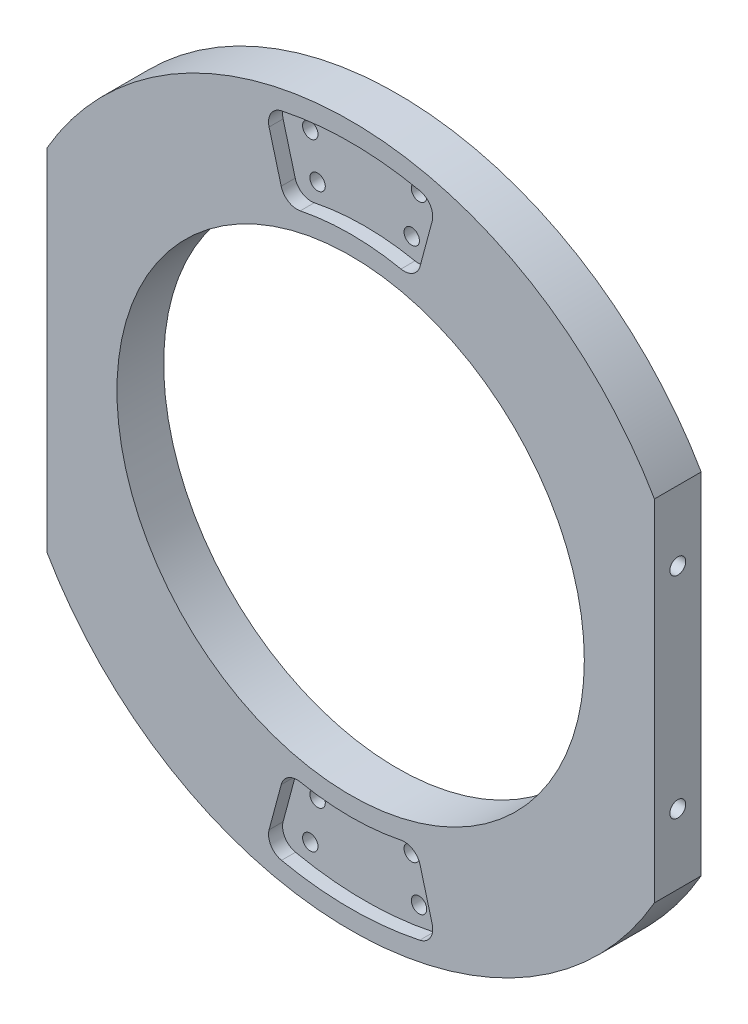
from build123d import *

# Parameters (mm, degrees)
SKETCH1_R                                    = 150
SKETCH1_R_2                                  = 100
BOSS_EXTRUDE1_DEPTH                          = 20
CUT_EXTRUDE1_DEPTH                           = 6
FILLET1_R                                    = 7
CBORE_FOR_M6_HEX_SOCKET_HEAD_CAP_SCR_2_COUNT = 2
CBORE_FOR_M6_HEX_SOCKET_HEAD_CAP_SCR_2_PITCH = 46.891745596
CBORE_FOR_M6_HEX_SOCKET_HEAD_CAP_SCR_3_COUNT = 2
CBORE_FOR_M6_HEX_SOCKET_HEAD_CAP_SCR_3_PITCH = 40.286377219
CBORE_FOR_M6_HEX_SOCKET_HEAD_CAP_SCR_4_COUNT = 2
CBORE_FOR_M6_HEX_SOCKET_HEAD_CAP_SCR_4_PITCH = 18
FILLET1_OF_MIRROR1_R                         = 7
SKETCH5_OUTSIDE_W                            = 386.948
SKETCH5_OUTSIDE_H                            = 386.948
SKETCH5_OUTSIDE_W_2                          = 260
SKETCH5_OUTSIDE_H_2                          = 300
CUT_EXTRUDE2_DEPTH                           = 214.072757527
M8_TAPPED_HOLE1_AT_2_COUNT                   = 2
M8_TAPPED_HOLE1_AT_2_PITCH                   = 90


with BuildPart() as part:
    # Sketch1 → Boss-Extrude1 (new body)
    with BuildSketch(Plane.XY):
        Circle(SKETCH1_R)
        Circle(SKETCH1_R_2, mode=Mode.SUBTRACT)
    extrude(amount=-BOSS_EXTRUDE1_DEPTH)

    # Sketch2 → Cut-Extrude1 (cut)
    with BuildSketch(Plane.XY):
        with BuildLine():
            Line((-27.952456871, 104.319989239), (-36.752304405, 137.161467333))
            ThreePointArc((-36.752304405, 137.161467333), (0, 142), (36.752304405, 137.161467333))
            Line((36.752304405, 137.161467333), (27.952456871, 104.319989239))
            ThreePointArc((27.952456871, 104.319989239), (0, 108), (-27.952456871, 104.319989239))
        make_face()
    cut_extrude1 = extrude(amount=-CUT_EXTRUDE1_DEPTH, mode=Mode.SUBTRACT)

    # Fillet1
    fillet1_edges = [part.edges().sort_by_distance(p)[0] for p in [
        (27.952456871, 104.319989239, -3),
        (-27.952456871, 104.319989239, -3),
        (-36.752304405, 137.161467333, -3),
        (36.752304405, 137.161467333, -3),
    ]]
    fillet(fillet1_edges, radius=FILLET1_R)

    # Sketch3 → CBORE for M6 Hex Socket Head Cap Screw1 (revolve, cut)
    with BuildSketch(Plane(origin=(20.143188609, 114.237699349, -20), x_dir=(0, 1, 0), z_dir=(1, 0, 0))):
        Polygon((0, 0), (0, 20), (3.3, 20), (3.3, 6.4), (5.5, 6.4), (5.5, 0.5), (6, 0), align=None)
    cbore_for_m6_hex_socket_head_cap_screw1 = revolve(axis=Axis((20.143188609, 114.237699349, -26.35), (0, 0, 1)), mode=Mode.SUBTRACT)

    # CBORE for M6 Hex Socket Head Cap Scr 2: CBORE for M6 Hex Socket Head Cap Screw1 ×2
    with Locations(*[Vector(-0.9257928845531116, 0.378031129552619, 0) * (i * CBORE_FOR_M6_HEX_SOCKET_HEAD_CAP_SCR_2_PITCH) for i in range(1, CBORE_FOR_M6_HEX_SOCKET_HEAD_CAP_SCR_2_COUNT)]):
        add(cbore_for_m6_hex_socket_head_cap_screw1, mode=Mode.SUBTRACT)

    # CBORE for M6 Hex Socket Head Cap Scr 3: CBORE for M6 Hex Socket Head Cap Screw1 ×2
    with Locations(*[(-i * CBORE_FOR_M6_HEX_SOCKET_HEAD_CAP_SCR_3_PITCH, 0, 0) for i in range(1, CBORE_FOR_M6_HEX_SOCKET_HEAD_CAP_SCR_3_COUNT)]):
        add(cbore_for_m6_hex_socket_head_cap_screw1, mode=Mode.SUBTRACT)

    # CBORE for M6 Hex Socket Head Cap Scr 4: CBORE for M6 Hex Socket Head Cap Screw1 ×2
    with Locations(*[Vector(0.1736481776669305, 0.984807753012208, 0) * (i * CBORE_FOR_M6_HEX_SOCKET_HEAD_CAP_SCR_4_PITCH) for i in range(1, CBORE_FOR_M6_HEX_SOCKET_HEAD_CAP_SCR_4_COUNT)]):
        add(cbore_for_m6_hex_socket_head_cap_screw1, mode=Mode.SUBTRACT)

    # Mirror1: Cut-Extrude1, CBORE for M6 Hex Socket Head Cap Screw1 across plane
    add(cut_extrude1.mirror(Plane.ZX), mode=Mode.SUBTRACT)
    add(cbore_for_m6_hex_socket_head_cap_screw1.mirror(Plane.ZX), mode=Mode.SUBTRACT)

    # Mirror1 copy 1 sketch → Mirror1 copy 1 (revolve, cut)
    with BuildSketch(Plane(origin=(-23.268855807, -131.964238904, -20), x_dir=(0, -1, 0), z_dir=(1, 0, 0))):
        Polygon((0, 0), (0, -20), (3.3, -20), (3.3, -6.4), (5.5, -6.4), (5.5, -0.5), (6, 0), align=None)
    revolve(axis=Axis((-23.268855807, -131.964238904, -26.35), (0, 0, -1)), mode=Mode.SUBTRACT)

    # Mirror1 copy 2 sketch → Mirror1 copy 2 (revolve, cut)
    with BuildSketch(Plane(origin=(-20.143188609, -114.237699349, -20), x_dir=(0, -1, 0), z_dir=(1, 0, 0))):
        Polygon((0, 0), (0, -20), (3.3, -20), (3.3, -6.4), (5.5, -6.4), (5.5, -0.5), (6, 0), align=None)
    revolve(axis=Axis((-20.143188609, -114.237699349, -26.35), (0, 0, -1)), mode=Mode.SUBTRACT)

    # Mirror1 copy 3 sketch → Mirror1 copy 3 (revolve, cut)
    with BuildSketch(Plane(origin=(23.268855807, -131.964238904, -20), x_dir=(0, -1, 0), z_dir=(1, 0, 0))):
        Polygon((0, 0), (0, -20), (3.3, -20), (3.3, -6.4), (5.5, -6.4), (5.5, -0.5), (6, 0), align=None)
    revolve(axis=Axis((23.268855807, -131.964238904, -26.35), (0, 0, -1)), mode=Mode.SUBTRACT)

    # Fillet1 of Mirror1
    fillet1_of_mirror1_edges = [part.edges().sort_by_distance(p)[0] for p in [
        (27.952456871, -104.319989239, -3),
        (-27.952456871, -104.319989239, -3),
        (-36.752304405, -137.161467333, -3),
        (36.752304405, -137.161467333, -3),
    ]]
    fillet(fillet1_of_mirror1_edges, radius=FILLET1_OF_MIRROR1_R)

    # Sketch5 outside → Cut-Extrude2 (cut, through all)
    with BuildSketch(Plane.XY):
        Rectangle(SKETCH5_OUTSIDE_W, SKETCH5_OUTSIDE_H)
        Rectangle(SKETCH5_OUTSIDE_W_2, SKETCH5_OUTSIDE_H_2, mode=Mode.SUBTRACT)
    extrude(amount=-CUT_EXTRUDE2_DEPTH, mode=Mode.SUBTRACT)

    # Sketch6 → M8 Tapped Hole1 (revolve, cut)
    with BuildSketch(Plane(origin=(130, 45, -10), x_dir=(0, 0, -1), z_dir=(0, 1, 0))):
        Polygon((0, 0), (0, 24.292926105), (3.4, 22.25), (3.4, 0), align=None)
    m8_tapped_hole1 = revolve(axis=Axis((136.35, 45, -10), (-1, 0, 0)), mode=Mode.SUBTRACT)

    # M8 Tapped Hole1 at 2: M8 Tapped Hole1 ×2
    with Locations(*[(0, -i * M8_TAPPED_HOLE1_AT_2_PITCH, 0) for i in range(1, M8_TAPPED_HOLE1_AT_2_COUNT)]):
        add(m8_tapped_hole1, mode=Mode.SUBTRACT)

    # Mirror2: M8 Tapped Hole1 across plane
    add(m8_tapped_hole1.mirror(Plane(origin=(0, 0, 0), x_dir=(0, 0, 1), z_dir=(1, 0, 0))), mode=Mode.SUBTRACT)

    # Mirror2 copy 1 sketch → Mirror2 copy 1 (revolve, cut)
    with BuildSketch(Plane(origin=(-130, -45, -10), x_dir=(0, 0, -1), z_dir=(0, 1, 0))):
        Polygon((0, 0), (0, -24.292926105), (3.4, -22.25), (3.4, 0), align=None)
    revolve(axis=Axis((-136.35, -45, -10), (-1, 0, 0)), mode=Mode.SUBTRACT)


solid = part.part
